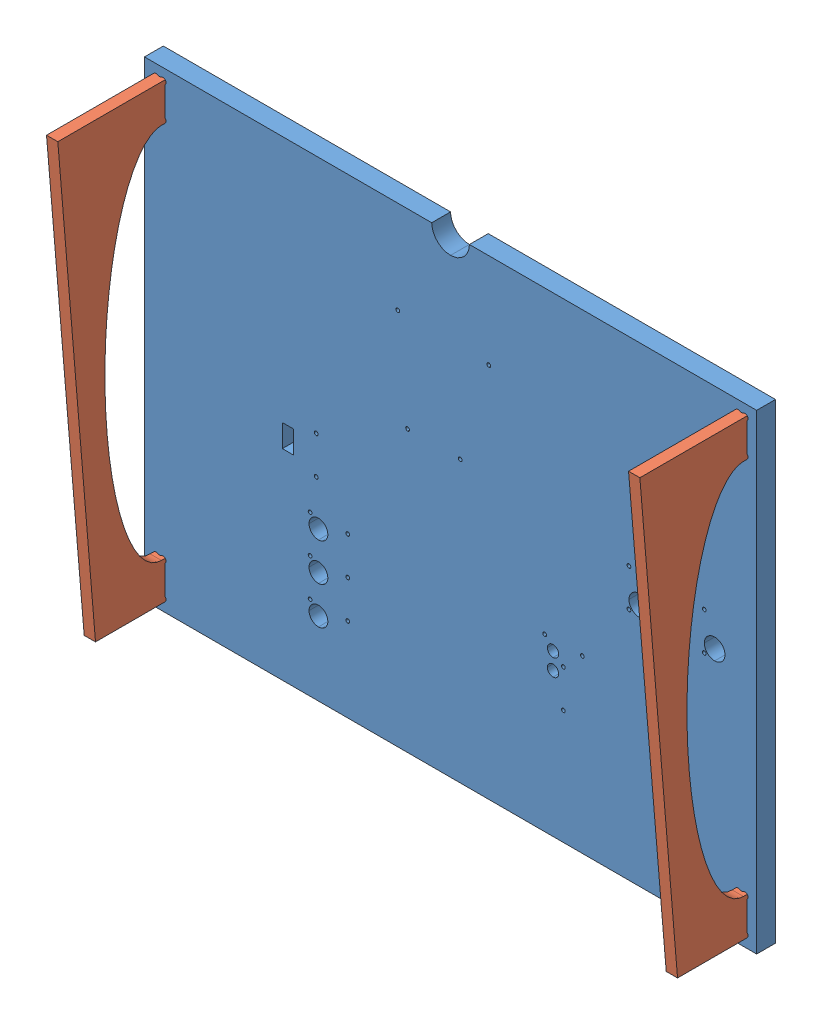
SolidWorks assembly THEMA-FEU-TRI complet.SLDASM, configuration Défaut (file format 8000). Lengths in mm.
Overall size (325 250 67).
3 component instances, 2 part files, 6 mates.
Components (placement in the parent):
- THEMA-FEU-TRI-1-PLAT-1: THEMA-FEU-TRI-1-PLAT.SLDPRT [Défaut] at (-202.6041 84.4207 319.9989) size (325 250 10)
- THEMA-EQUER-1: THEMA-EQUER.SLDPRT [Défaut] at (-182.2446 -123.033 326.9989) x (1 0 0) z (0 -1 0) size (6 60 240)
- THEMA-EQUER-2: THEMA-EQUER.SLDPRT [Défaut] at (126.7542 -123.033 326.9989) x (1 0 0) z (0 -1 0) size (6 60 240)
Mates (geometry in assembly coordinates):
- Coïncidente1: coincident anti-aligned: plane of THEMA-FEU-TRI-1-PLAT-1 through (127.8858 -123.5017 326.9989) normal (0 0 1); plane of THEMA-EQUER-2 through (132.7542 -123.033 326.9989) normal (0 0 -1)
- Coïncidente2: coincident anti-aligned: plane of THEMA-FEU-TRI-1-PLAT-1 through (132.7542 -105.2959 326.9989) normal (-1 0 0); plane of THEMA-EQUER-2 through (132.7542 -3.033 331.9989) normal (1 0 0)
- Coïncidente3: coincident anti-aligned: plane of THEMA-FEU-TRI-1-PLAT-1 through (130.4915 -123.033 326.9989) normal (0 1 0); plane of THEMA-EQUER-2 through (132.7542 -123.033 366.9989) normal (0 -1 0)
- Coïncidente4: coincident anti-aligned: plane of THEMA-FEU-TRI-1-PLAT-1 through (-177.3759 -102.5645 326.9989) normal (0 0 1); plane of THEMA-EQUER-1 through (-176.2446 -123.033 326.9989) normal (0 0 -1)
- Coïncidente5: coincident anti-aligned: plane of THEMA-FEU-TRI-1-PLAT-1 through (-182.2446 -120.7703 326.9989) normal (1 0 0); plane of THEMA-EQUER-1 through (-182.2446 -3.033 331.9989) normal (-1 0 0)
- Coïncidente6: coincident anti-aligned: plane of THEMA-FEU-TRI-1-PLAT-1 through (-178.5074 -123.033 326.9989) normal (0 1 0); plane of THEMA-EQUER-1 through (-176.2446 -123.033 366.9989) normal (0 -1 0)
